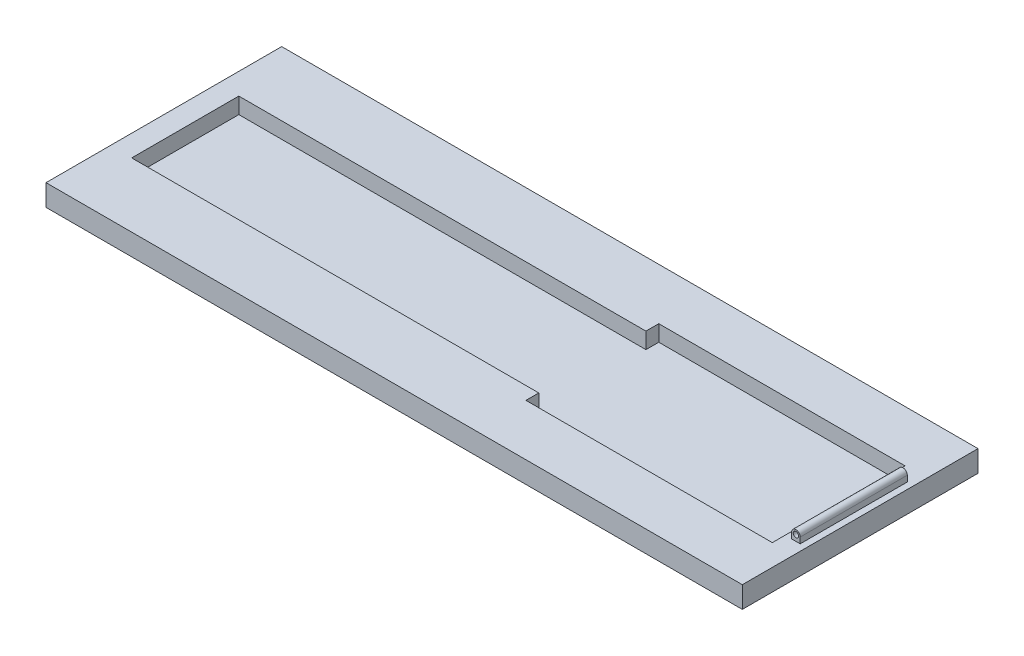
from build123d import *

# Parameters (mm, degrees)
ESQUISSE1_W             = 6500
ESQUISSE1_H             = 200
EXTRUSION1_DEPTH        = 1100
ESQUISSE2_R             = 25
EXTRUSION2_DEPTH        = 500
ENL_V_MAT_EXTRU_1_DEPTH = 150


with BuildPart() as part:
    # Esquisse1 → Extrusion1 (new, symmetric)
    with BuildSketch(Plane.XY):
        with Locations((-3150, -155)):
            Rectangle(ESQUISSE1_W, ESQUISSE1_H)
    extrude(amount=EXTRUSION1_DEPTH, both=True)

    # Esquisse2 → Extrusion2 (add, symmetric)
    with BuildSketch(Plane.XY):
        with BuildLine():
            Line((-40, 0), (-40, -55))
            Line((-40, -55), (40, -55))
            Line((40, -55), (40, 0))
            ThreePointArc((40, 0), (0, 40), (-40, 0))
        make_face()
        Circle(ESQUISSE2_R, mode=Mode.SUBTRACT)
    extrude(amount=EXTRUSION2_DEPTH, both=True)

    # Esquisse3 → Enl_v. mat.-Extru.1 (cut)
    with BuildSketch(Plane(origin=(0, -55, 0), x_dir=(1, 0, 0), z_dir=(0, 1, 0))):
        Polygon((-2400, 620), (-100, 620), (-100, -620), (-2400, -620), (-2400, -500), (-6200, -500), (-6200, 500), (-2400, 500), align=None)
    extrude(amount=-ENL_V_MAT_EXTRU_1_DEPTH, mode=Mode.SUBTRACT)


solid = part.part
